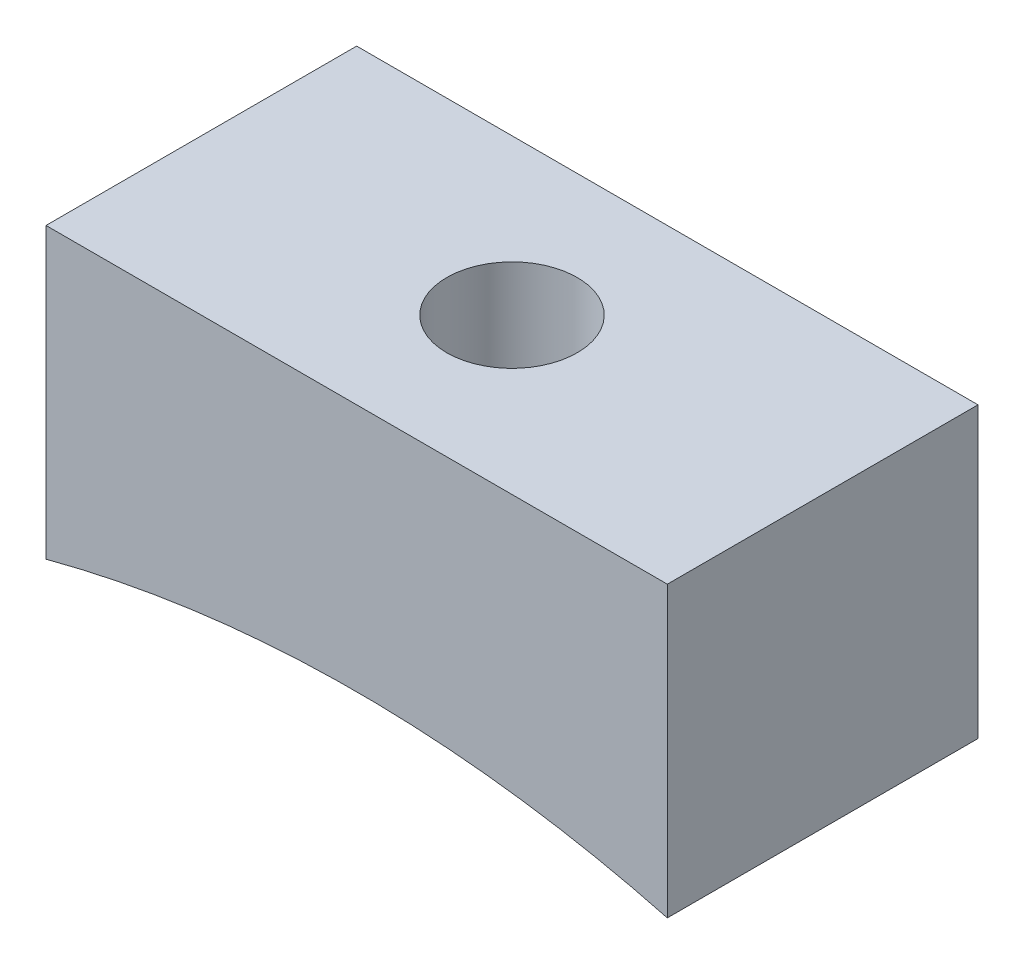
ISO-10303-21;
HEADER;
FILE_DESCRIPTION(('STEP AP214'),'2;1');
FILE_NAME('part.step','',(''),(''),'','','');
FILE_SCHEMA(('AUTOMOTIVE_DESIGN { 1 0 10303 214 1 1 1 1 }'));
ENDSEC;
DATA;
#1=APPLICATION_CONTEXT('core data for automotive mechanical design processes');
#2=APPLICATION_PROTOCOL_DEFINITION('international standard','automotive_design',2000,#1);
#3=PRODUCT_CONTEXT('',#1,'mechanical');
#4=PRODUCT('Part','Part','',(#3));
#5=PRODUCT_RELATED_PRODUCT_CATEGORY('part','',(#4));
#6=PRODUCT_DEFINITION_FORMATION('','',#4);
#7=PRODUCT_DEFINITION_CONTEXT('part definition',#1,'design');
#8=PRODUCT_DEFINITION('design','',#6,#7);
#9=PRODUCT_DEFINITION_SHAPE('','',#8);
#10=(LENGTH_UNIT() NAMED_UNIT(*) SI_UNIT(.MILLI.,.METRE.));
#11=(NAMED_UNIT(*) PLANE_ANGLE_UNIT() SI_UNIT($,.RADIAN.));
#12=(NAMED_UNIT(*) SI_UNIT($,.STERADIAN.) SOLID_ANGLE_UNIT());
#13=UNCERTAINTY_MEASURE_WITH_UNIT(LENGTH_MEASURE(1.E-05),#10,'distance_accuracy_value','');
#14=(GEOMETRIC_REPRESENTATION_CONTEXT(3) GLOBAL_UNCERTAINTY_ASSIGNED_CONTEXT((#13)) GLOBAL_UNIT_ASSIGNED_CONTEXT((#10,
#11,#12)) REPRESENTATION_CONTEXT('',''));
#15=CARTESIAN_POINT('',(0.,0.,0.));
#16=DIRECTION('',(0.,0.,1.));
#17=DIRECTION('',(1.,0.,0.));
#18=AXIS2_PLACEMENT_3D('',#15,#16,#17);
#19=CARTESIAN_POINT('',(0.,0.,-5.));
#20=DIRECTION('',(0.,0.,1.));
#21=DIRECTION('',(1.,0.,0.));
#22=AXIS2_PLACEMENT_3D('',#19,#20,#21);
#23=CYLINDRICAL_SURFACE('',#22,39.);
#24=CARTESIAN_POINT('',(0.,39.0000000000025,2.1));
#25=CARTESIAN_POINT('',(0.117866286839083,38.9999992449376,2.09999480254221));
#26=CARTESIAN_POINT('',(0.235815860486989,38.9994599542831,2.09004348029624));
#27=CARTESIAN_POINT('',(0.468460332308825,38.9973604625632,2.05048729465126));
#28=CARTESIAN_POINT('',(0.583151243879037,38.9957990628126,2.02085935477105));
#29=CARTESIAN_POINT('',(0.805874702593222,38.9918320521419,1.94280144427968));
#30=CARTESIAN_POINT('',(0.913910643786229,38.9894268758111,1.89438115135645));
#31=CARTESIAN_POINT('',(1.12029230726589,38.9840430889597,1.78012811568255));
#32=CARTESIAN_POINT('',(1.21864029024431,38.9810646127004,1.71429944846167));
#33=CARTESIAN_POINT('',(1.40299625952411,38.9748653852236,1.56701458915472));
#34=CARTESIAN_POINT('',(1.48899170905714,38.9716443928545,1.48554271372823));
#35=CARTESIAN_POINT('',(1.64609454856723,38.9653252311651,1.30931580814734));
#36=CARTESIAN_POINT('',(1.71720132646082,38.9622270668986,1.21456023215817));
#37=CARTESIAN_POINT('',(1.84254440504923,38.9565011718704,1.01438802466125));
#38=CARTESIAN_POINT('',(1.89677068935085,38.9538737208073,0.908965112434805));
#39=CARTESIAN_POINT('',(1.98674929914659,38.9493885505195,0.690494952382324));
#40=CARTESIAN_POINT('',(2.02250178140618,38.947530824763,0.577447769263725));
#41=CARTESIAN_POINT('',(2.07448417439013,38.9447968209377,0.347055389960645));
#42=CARTESIAN_POINT('',(2.09073316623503,38.9439195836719,0.229714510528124));
#43=CARTESIAN_POINT('',(2.10330621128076,38.9432426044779,-0.00603237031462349));
#44=CARTESIAN_POINT('',(2.09963044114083,38.9434428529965,-0.124438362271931));
#45=CARTESIAN_POINT('',(2.07247417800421,38.944897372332,-0.358824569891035));
#46=CARTESIAN_POINT('',(2.04901430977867,38.946150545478,-0.474807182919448));
#47=CARTESIAN_POINT('',(1.9829877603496,38.9495679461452,-0.701185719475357));
#48=CARTESIAN_POINT('',(1.9404209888,38.9517321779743,-0.811581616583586));
#49=CARTESIAN_POINT('',(1.83736543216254,38.9567290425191,-1.02371938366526));
#50=CARTESIAN_POINT('',(1.77686725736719,38.9595620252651,-1.12545668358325));
#51=CARTESIAN_POINT('',(1.6396730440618,38.9655767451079,-1.31733933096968));
#52=CARTESIAN_POINT('',(1.56297687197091,38.9687584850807,-1.40748458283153));
#53=CARTESIAN_POINT('',(1.39544746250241,38.9751169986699,-1.57374427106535));
#54=CARTESIAN_POINT('',(1.30459636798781,38.9782937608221,-1.6498407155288));
#55=CARTESIAN_POINT('',(1.11139875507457,38.9842803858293,-1.78570401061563));
#56=CARTESIAN_POINT('',(1.00905223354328,38.9870902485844,-1.84547085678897));
#57=CARTESIAN_POINT('',(0.79575837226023,38.9920265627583,-1.9469767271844));
#58=CARTESIAN_POINT('',(0.684810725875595,38.9941529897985,-1.98871510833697));
#59=CARTESIAN_POINT('',(0.457468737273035,38.9974824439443,-2.05296741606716));
#60=CARTESIAN_POINT('',(0.341074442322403,38.9986854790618,-2.07548150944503));
#61=CARTESIAN_POINT('',(0.106299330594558,39.0000315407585,-2.10062394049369));
#62=CARTESIAN_POINT('',(-0.0120788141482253,39.0001758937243,-2.10327716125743));
#63=CARTESIAN_POINT('',(-0.247598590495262,38.9993918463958,-2.08868749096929));
#64=CARTESIAN_POINT('',(-0.364740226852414,38.9984634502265,-2.07144467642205));
#65=CARTESIAN_POINT('',(-0.594391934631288,38.9956393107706,-2.0175729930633));
#66=CARTESIAN_POINT('',(-0.706904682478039,38.9937441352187,-1.98095550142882));
#67=CARTESIAN_POINT('',(-0.924187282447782,38.9891997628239,-1.88938543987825));
#68=CARTESIAN_POINT('',(-1.02895708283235,38.9865505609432,-1.83443274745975));
#69=CARTESIAN_POINT('',(-1.22789392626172,38.9807927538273,-1.70768858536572));
#70=CARTESIAN_POINT('',(-1.32205034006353,38.9776836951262,-1.63588045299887));
#71=CARTESIAN_POINT('',(-1.49698074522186,38.9713577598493,-1.47748809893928));
#72=CARTESIAN_POINT('',(-1.57775463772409,38.9681408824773,-1.39090376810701));
#73=CARTESIAN_POINT('',(-1.72371104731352,38.9619580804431,-1.20530969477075));
#74=CARTESIAN_POINT('',(-1.78887745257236,38.9589924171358,-1.10628727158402));
#75=CARTESIAN_POINT('',(-1.90165891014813,38.9536505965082,-0.898691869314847));
#76=CARTESIAN_POINT('',(-1.94927404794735,38.9512744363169,-0.790118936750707));
#77=CARTESIAN_POINT('',(-2.02557331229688,38.947381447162,-0.566563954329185));
#78=CARTESIAN_POINT('',(-2.05426767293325,38.9458641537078,-0.451585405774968));
#79=CARTESIAN_POINT('',(-2.09194431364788,38.9438586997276,-0.218434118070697));
#80=CARTESIAN_POINT('',(-2.10092672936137,38.9433705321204,-0.100261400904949));
#81=CARTESIAN_POINT('',(-2.09892322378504,38.9434785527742,0.135763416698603));
#82=CARTESIAN_POINT('',(-2.08796264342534,38.9440733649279,0.253615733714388));
#83=CARTESIAN_POINT('',(-2.04643670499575,38.9462773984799,0.48580432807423));
#84=CARTESIAN_POINT('',(-2.01587131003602,38.9478866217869,0.600140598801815));
#85=CARTESIAN_POINT('',(-1.93600873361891,38.9519377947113,0.822056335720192));
#86=CARTESIAN_POINT('',(-1.88671148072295,38.9543797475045,0.929635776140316));
#87=CARTESIAN_POINT('',(-1.77078859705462,38.9598210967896,1.13499329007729));
#88=CARTESIAN_POINT('',(-1.70416347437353,38.9628204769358,1.23277165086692));
#89=CARTESIAN_POINT('',(-1.55538420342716,38.9690430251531,1.41587875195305));
#90=CARTESIAN_POINT('',(-1.47321213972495,38.9722664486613,1.50119292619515));
#91=CARTESIAN_POINT('',(-1.29568808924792,38.9785718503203,1.65684309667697));
#92=CARTESIAN_POINT('',(-1.20033287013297,38.9816537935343,1.72717540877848));
#93=CARTESIAN_POINT('',(-0.999064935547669,38.9873313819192,1.85090358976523));
#94=CARTESIAN_POINT('',(-0.893141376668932,38.9899265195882,1.90428182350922));
#95=CARTESIAN_POINT('',(-0.673900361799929,38.9943307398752,1.99243220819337));
#96=CARTESIAN_POINT('',(-0.56059179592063,38.9961407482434,2.02722628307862));
#97=CARTESIAN_POINT('',(-0.372151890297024,38.9982932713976,2.06811773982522));
#98=CARTESIAN_POINT('',(-0.298240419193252,38.9989304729,2.0800582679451));
#99=CARTESIAN_POINT('',(-0.149563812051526,38.9997840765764,2.09600104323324));
#100=CARTESIAN_POINT('',(-0.0747986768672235,39.0000004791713,2.10000329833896));
#101=CARTESIAN_POINT('',(0.,39.0000000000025,2.1));
#102=B_SPLINE_CURVE_WITH_KNOTS('',3,(#24,#25,#26,#27,#28,#29,#30,#31,#32,#33,#34,#35,#36,#37,
#38,#39,#40,#41,#42,#43,#44,#45,#46,#47,#48,#49,#50,#51,#52,#53,#54,#55,#56,#57,#58,#59,#60,#61,
#62,#63,#64,#65,#66,#67,#68,#69,#70,#71,#72,#73,#74,#75,#76,#77,#78,#79,#80,#81,#82,#83,#84,#85,
#86,#87,#88,#89,#90,#91,#92,#93,#94,#95,#96,#97,#98,#99,#100,#101),.UNSPECIFIED.,.T.,.F.,(4,2,2,
2,2,2,2,2,2,2,2,2,2,2,2,2,2,2,2,2,2,2,2,2,2,2,2,2,2,2,2,2,2,2,2,2,2,2,4),(0.,0.353325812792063,
0.707066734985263,1.06062572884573,1.41410202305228,1.76793456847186,2.12178165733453,
2.47583831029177,2.82989195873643,3.18359893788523,3.537302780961,3.89063834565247,
4.24397558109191,4.59749816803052,4.95102367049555,5.30499882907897,5.65897408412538,
6.01296196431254,6.36694677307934,6.72048801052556,7.07402788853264,7.42736039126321,
7.7806952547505,8.13438089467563,8.48806914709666,8.84212095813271,9.19617104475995,
9.5500294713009,9.90388546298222,10.2572921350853,10.6106994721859,10.9641081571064,
11.3175064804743,11.6713145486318,12.0252095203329,12.3794714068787,12.7333144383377,
12.9575374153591,13.1817601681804),.UNSPECIFIED.);
#103=CARTESIAN_POINT('',(0.,39.0000000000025,2.1));
#104=VERTEX_POINT('',#103);
#105=EDGE_CURVE('E97',#104,#104,#102,.T.);
#106=ORIENTED_EDGE('',*,*,#105,.T.);
#107=EDGE_LOOP('',(#106));
#108=FACE_BOUND('',#107,.T.);
#109=DIRECTION('',(0.,0.,1.));
#110=VECTOR('',#109,1.);
#111=CARTESIAN_POINT('',(10.,37.696153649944,-5.));
#112=LINE('',#111,#110);
#113=CARTESIAN_POINT('',(10.,37.696153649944,-5.));
#114=VERTEX_POINT('',#113);
#115=CARTESIAN_POINT('',(10.,37.696153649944,5.));
#116=VERTEX_POINT('',#115);
#117=EDGE_CURVE('E39',#114,#116,#112,.T.);
#118=ORIENTED_EDGE('',*,*,#117,.T.);
#119=CARTESIAN_POINT('',(0.,0.,5.));
#120=DIRECTION('',(0.,0.,-1.));
#121=DIRECTION('',(1.,0.,0.));
#122=AXIS2_PLACEMENT_3D('',#119,#120,#121);
#123=CIRCLE('',#122,39.);
#124=CARTESIAN_POINT('',(-10.,37.696153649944,5.));
#125=VERTEX_POINT('',#124);
#126=EDGE_CURVE('E76',#125,#116,#123,.T.);
#127=ORIENTED_EDGE('',*,*,#126,.F.);
#128=DIRECTION('',(0.,0.,1.));
#129=VECTOR('',#128,1.);
#130=CARTESIAN_POINT('',(-10.,37.696153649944,-5.));
#131=LINE('',#130,#129);
#132=CARTESIAN_POINT('',(-10.,37.696153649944,-5.));
#133=VERTEX_POINT('',#132);
#134=EDGE_CURVE('E11',#133,#125,#131,.T.);
#135=ORIENTED_EDGE('',*,*,#134,.F.);
#136=CARTESIAN_POINT('',(0.,0.,-5.));
#137=DIRECTION('',(0.,0.,-1.));
#138=DIRECTION('',(1.,0.,0.));
#139=AXIS2_PLACEMENT_3D('',#136,#137,#138);
#140=CIRCLE('',#139,39.);
#141=EDGE_CURVE('E77',#133,#114,#140,.T.);
#142=ORIENTED_EDGE('',*,*,#141,.T.);
#143=EDGE_LOOP('',(#118,#127,#135,#142));
#144=FACE_BOUND('',#143,.T.);
#145=ADVANCED_FACE('F36',(#108,#144),#23,.F.);
#146=CARTESIAN_POINT('',(-10.,37.696153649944,-5.));
#147=DIRECTION('',(-1.,0.,0.));
#148=DIRECTION('',(0.,0.,1.));
#149=AXIS2_PLACEMENT_3D('',#146,#147,#148);
#150=PLANE('',#149);
#151=ORIENTED_EDGE('',*,*,#134,.T.);
#152=DIRECTION('',(0.,-1.00000000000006,0.));
#153=VECTOR('',#152,1.);
#154=CARTESIAN_POINT('',(-10.,37.696153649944,5.));
#155=LINE('',#154,#153);
#156=CARTESIAN_POINT('',(-9.99999999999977,47.0000000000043,5.));
#157=VERTEX_POINT('',#156);
#158=EDGE_CURVE('E93',#157,#125,#155,.T.);
#159=ORIENTED_EDGE('',*,*,#158,.F.);
#160=DIRECTION('',(0.,0.,1.));
#161=VECTOR('',#160,1.);
#162=CARTESIAN_POINT('',(-10.,47.0000000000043,-5.));
#163=LINE('',#162,#161);
#164=CARTESIAN_POINT('',(-10.,47.0000000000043,-5.));
#165=VERTEX_POINT('',#164);
#166=EDGE_CURVE('E44',#165,#157,#163,.T.);
#167=ORIENTED_EDGE('',*,*,#166,.F.);
#168=DIRECTION('',(0.,-1.00000000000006,0.));
#169=VECTOR('',#168,1.);
#170=CARTESIAN_POINT('',(-10.,37.696153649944,-5.));
#171=LINE('',#170,#169);
#172=EDGE_CURVE('E82',#165,#133,#171,.T.);
#173=ORIENTED_EDGE('',*,*,#172,.T.);
#174=EDGE_LOOP('',(#151,#159,#167,#173));
#175=FACE_BOUND('',#174,.T.);
#176=ADVANCED_FACE('F117',(#175),#150,.T.);
#177=CARTESIAN_POINT('',(-10.,47.0000000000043,-5.));
#178=DIRECTION('',(0.,1.00000000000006,0.));
#179=DIRECTION('',(0.,0.,1.));
#180=AXIS2_PLACEMENT_3D('',#177,#178,#179);
#181=PLANE('',#180);
#182=CARTESIAN_POINT('',(0.,47.0000000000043,0.));
#183=DIRECTION('',(0.,1.00000000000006,0.));
#184=DIRECTION('',(0.,0.,1.));
#185=AXIS2_PLACEMENT_3D('',#182,#183,#184);
#186=CIRCLE('',#185,2.1);
#187=CARTESIAN_POINT('',(0.,47.0000000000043,2.1));
#188=VERTEX_POINT('',#187);
#189=EDGE_CURVE('E94',#188,#188,#186,.T.);
#190=ORIENTED_EDGE('',*,*,#189,.F.);
#191=EDGE_LOOP('',(#190));
#192=FACE_BOUND('',#191,.T.);
#193=ORIENTED_EDGE('',*,*,#166,.T.);
#194=DIRECTION('',(-1.,0.,0.));
#195=VECTOR('',#194,1.);
#196=CARTESIAN_POINT('',(-9.99999999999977,47.0000000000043,5.));
#197=LINE('',#196,#195);
#198=CARTESIAN_POINT('',(10.0000000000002,47.0000000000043,5.));
#199=VERTEX_POINT('',#198);
#200=EDGE_CURVE('E89',#199,#157,#197,.T.);
#201=ORIENTED_EDGE('',*,*,#200,.F.);
#202=DIRECTION('',(0.,0.,1.));
#203=VECTOR('',#202,1.);
#204=CARTESIAN_POINT('',(9.99999999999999,47.0000000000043,-5.));
#205=LINE('',#204,#203);
#206=CARTESIAN_POINT('',(9.99999999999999,47.0000000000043,-5.));
#207=VERTEX_POINT('',#206);
#208=EDGE_CURVE('E81',#207,#199,#205,.T.);
#209=ORIENTED_EDGE('',*,*,#208,.F.);
#210=DIRECTION('',(-1.,0.,0.));
#211=VECTOR('',#210,1.);
#212=CARTESIAN_POINT('',(-10.,47.0000000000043,-5.));
#213=LINE('',#212,#211);
#214=EDGE_CURVE('E110',#207,#165,#213,.T.);
#215=ORIENTED_EDGE('',*,*,#214,.T.);
#216=EDGE_LOOP('',(#193,#201,#209,#215));
#217=FACE_BOUND('',#216,.T.);
#218=ADVANCED_FACE('F114',(#192,#217),#181,.T.);
#219=CARTESIAN_POINT('',(9.99999999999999,47.0000000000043,-5.));
#220=DIRECTION('',(1.,0.,0.));
#221=DIRECTION('',(0.,0.,-1.));
#222=AXIS2_PLACEMENT_3D('',#219,#220,#221);
#223=PLANE('',#222);
#224=ORIENTED_EDGE('',*,*,#208,.T.);
#225=DIRECTION('',(0.,1.00000000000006,0.));
#226=VECTOR('',#225,1.);
#227=CARTESIAN_POINT('',(10.0000000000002,47.0000000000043,5.));
#228=LINE('',#227,#226);
#229=EDGE_CURVE('E84',#116,#199,#228,.T.);
#230=ORIENTED_EDGE('',*,*,#229,.F.);
#231=ORIENTED_EDGE('',*,*,#117,.F.);
#232=DIRECTION('',(0.,1.00000000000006,0.));
#233=VECTOR('',#232,1.);
#234=CARTESIAN_POINT('',(9.99999999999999,47.0000000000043,-5.));
#235=LINE('',#234,#233);
#236=EDGE_CURVE('E108',#114,#207,#235,.T.);
#237=ORIENTED_EDGE('',*,*,#236,.T.);
#238=EDGE_LOOP('',(#224,#230,#231,#237));
#239=FACE_BOUND('',#238,.T.);
#240=ADVANCED_FACE('F85',(#239),#223,.T.);
#241=CARTESIAN_POINT('',(0.,0.,-5.));
#242=DIRECTION('',(0.,0.,1.));
#243=DIRECTION('',(1.,0.,0.));
#244=AXIS2_PLACEMENT_3D('',#241,#242,#243);
#245=PLANE('',#244);
#246=ORIENTED_EDGE('',*,*,#141,.F.);
#247=ORIENTED_EDGE('',*,*,#172,.F.);
#248=ORIENTED_EDGE('',*,*,#214,.F.);
#249=ORIENTED_EDGE('',*,*,#236,.F.);
#250=EDGE_LOOP('',(#246,#247,#248,#249));
#251=FACE_BOUND('',#250,.T.);
#252=ADVANCED_FACE('F119',(#251),#245,.F.);
#253=CARTESIAN_POINT('',(0.,0.,5.));
#254=DIRECTION('',(0.,0.,1.));
#255=DIRECTION('',(1.,0.,0.));
#256=AXIS2_PLACEMENT_3D('',#253,#254,#255);
#257=PLANE('',#256);
#258=ORIENTED_EDGE('',*,*,#126,.T.);
#259=ORIENTED_EDGE('',*,*,#229,.T.);
#260=ORIENTED_EDGE('',*,*,#200,.T.);
#261=ORIENTED_EDGE('',*,*,#158,.T.);
#262=EDGE_LOOP('',(#258,#259,#260,#261));
#263=FACE_BOUND('',#262,.T.);
#264=ADVANCED_FACE('F92',(#263),#257,.T.);
#265=CARTESIAN_POINT('',(0.,37.695153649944,0.));
#266=DIRECTION('',(0.,1.00000000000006,0.));
#267=DIRECTION('',(0.,0.,1.));
#268=AXIS2_PLACEMENT_3D('',#265,#266,#267);
#269=CYLINDRICAL_SURFACE('',#268,2.1);
#270=ORIENTED_EDGE('',*,*,#105,.F.);
#271=EDGE_LOOP('',(#270));
#272=FACE_BOUND('',#271,.T.);
#273=ORIENTED_EDGE('',*,*,#189,.T.);
#274=EDGE_LOOP('',(#273));
#275=FACE_BOUND('',#274,.T.);
#276=ADVANCED_FACE('F126',(#272,#275),#269,.F.);
#277=CLOSED_SHELL('',(#145,#176,#218,#240,#252,#264,#276));
#278=MANIFOLD_SOLID_BREP('B2',#277);
#279=ADVANCED_BREP_SHAPE_REPRESENTATION('',(#18,#278),#14);
#280=SHAPE_DEFINITION_REPRESENTATION(#9,#279);
ENDSEC;
END-ISO-10303-21;
